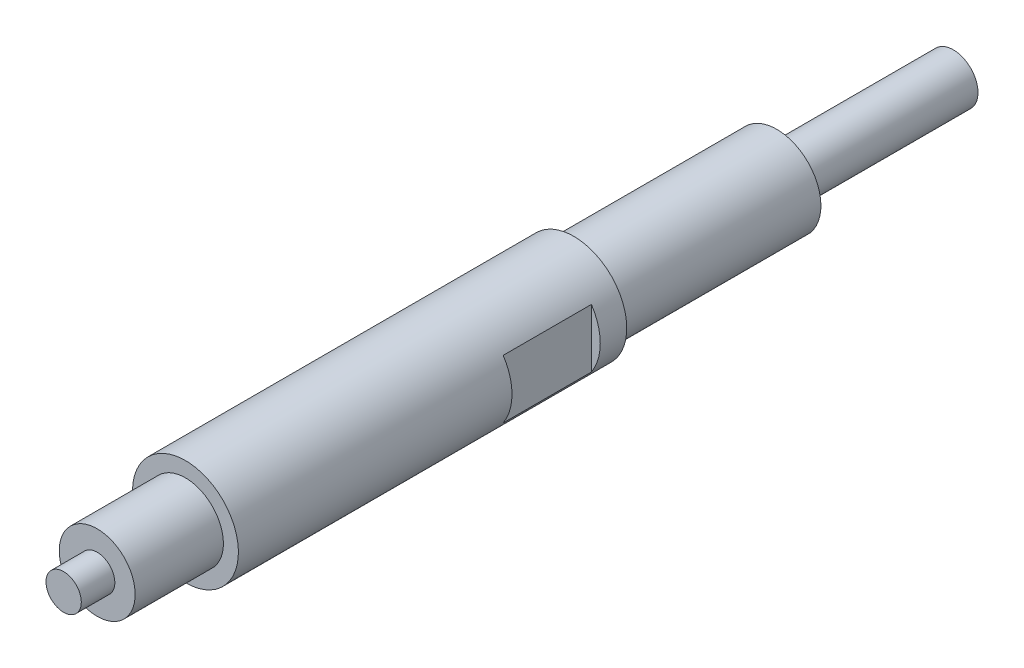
ISO-10303-21;
HEADER;
FILE_DESCRIPTION(('STEP AP214'),'2;1');
FILE_NAME('part.step','',(''),(''),'','','');
FILE_SCHEMA(('AUTOMOTIVE_DESIGN { 1 0 10303 214 1 1 1 1 }'));
ENDSEC;
DATA;
#1=APPLICATION_CONTEXT('core data for automotive mechanical design processes');
#2=APPLICATION_PROTOCOL_DEFINITION('international standard','automotive_design',2000,#1);
#3=PRODUCT_CONTEXT('',#1,'mechanical');
#4=PRODUCT('Part','Part','',(#3));
#5=PRODUCT_RELATED_PRODUCT_CATEGORY('part','',(#4));
#6=PRODUCT_DEFINITION_FORMATION('','',#4);
#7=PRODUCT_DEFINITION_CONTEXT('part definition',#1,'design');
#8=PRODUCT_DEFINITION('design','',#6,#7);
#9=PRODUCT_DEFINITION_SHAPE('','',#8);
#10=(LENGTH_UNIT() NAMED_UNIT(*) SI_UNIT(.MILLI.,.METRE.));
#11=(NAMED_UNIT(*) PLANE_ANGLE_UNIT() SI_UNIT($,.RADIAN.));
#12=(NAMED_UNIT(*) SI_UNIT($,.STERADIAN.) SOLID_ANGLE_UNIT());
#13=UNCERTAINTY_MEASURE_WITH_UNIT(LENGTH_MEASURE(1.E-05),#10,'distance_accuracy_value','');
#14=(GEOMETRIC_REPRESENTATION_CONTEXT(3) GLOBAL_UNCERTAINTY_ASSIGNED_CONTEXT((#13)) GLOBAL_UNIT_ASSIGNED_CONTEXT((#10,
#11,#12)) REPRESENTATION_CONTEXT('',''));
#15=CARTESIAN_POINT('',(0.,0.,0.));
#16=DIRECTION('',(0.,0.,1.));
#17=DIRECTION('',(1.,0.,0.));
#18=AXIS2_PLACEMENT_3D('',#15,#16,#17);
#19=CARTESIAN_POINT('',(1.,0.,-1.9));
#20=DIRECTION('',(0.,0.,-1.));
#21=DIRECTION('',(0.,1.,0.));
#22=AXIS2_PLACEMENT_3D('',#19,#20,#21);
#23=PLANE('',#22);
#24=CARTESIAN_POINT('',(0.,0.,-1.9));
#25=DIRECTION('',(0.,0.,1.));
#26=DIRECTION('',(0.,-1.,0.));
#27=AXIS2_PLACEMENT_3D('',#24,#25,#26);
#28=CIRCLE('',#27,1.);
#29=CARTESIAN_POINT('',(0.,-1.,-1.9));
#30=VERTEX_POINT('',#29);
#31=EDGE_CURVE('E108',#30,#30,#28,.T.);
#32=ORIENTED_EDGE('',*,*,#31,.F.);
#33=EDGE_LOOP('',(#32));
#34=FACE_BOUND('',#33,.T.);
#35=CARTESIAN_POINT('',(0.,0.,-1.9));
#36=DIRECTION('',(0.,0.,1.));
#37=DIRECTION('',(0.,-1.,0.));
#38=AXIS2_PLACEMENT_3D('',#35,#36,#37);
#39=CIRCLE('',#38,2.15);
#40=CARTESIAN_POINT('',(0.,-2.15,-1.9));
#41=VERTEX_POINT('',#40);
#42=EDGE_CURVE('E81',#41,#41,#39,.T.);
#43=ORIENTED_EDGE('',*,*,#42,.T.);
#44=EDGE_LOOP('',(#43));
#45=FACE_BOUND('',#44,.T.);
#46=ADVANCED_FACE('F14',(#34,#45),#23,.F.);
#47=CARTESIAN_POINT('',(0.,0.,6.09516340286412));
#48=DIRECTION('',(0.,0.,1.));
#49=DIRECTION('',(0.,-1.,0.));
#50=AXIS2_PLACEMENT_3D('',#47,#48,#49);
#51=CYLINDRICAL_SURFACE('',#50,2.15);
#52=ORIENTED_EDGE('',*,*,#42,.F.);
#53=EDGE_LOOP('',(#52));
#54=FACE_BOUND('',#53,.T.);
#55=CARTESIAN_POINT('',(0.,0.,-6.9));
#56=DIRECTION('',(0.,0.,1.));
#57=DIRECTION('',(0.,-1.,0.));
#58=AXIS2_PLACEMENT_3D('',#55,#56,#57);
#59=CIRCLE('',#58,2.15);
#60=CARTESIAN_POINT('',(0.,-2.15,-6.9));
#61=VERTEX_POINT('',#60);
#62=EDGE_CURVE('E84',#61,#61,#59,.T.);
#63=ORIENTED_EDGE('',*,*,#62,.T.);
#64=EDGE_LOOP('',(#63));
#65=FACE_BOUND('',#64,.T.);
#66=ADVANCED_FACE('F129',(#54,#65),#51,.T.);
#67=CARTESIAN_POINT('',(2.15,0.,-6.9));
#68=DIRECTION('',(0.,0.,-1.));
#69=DIRECTION('',(0.,1.,0.));
#70=AXIS2_PLACEMENT_3D('',#67,#68,#69);
#71=PLANE('',#70);
#72=ORIENTED_EDGE('',*,*,#62,.F.);
#73=EDGE_LOOP('',(#72));
#74=FACE_BOUND('',#73,.T.);
#75=CARTESIAN_POINT('',(0.,0.,-6.9));
#76=DIRECTION('',(0.,0.,1.));
#77=DIRECTION('',(0.,-1.,0.));
#78=AXIS2_PLACEMENT_3D('',#75,#76,#77);
#79=CIRCLE('',#78,3.);
#80=CARTESIAN_POINT('',(0.,-3.,-6.9));
#81=VERTEX_POINT('',#80);
#82=EDGE_CURVE('E87',#81,#81,#79,.T.);
#83=ORIENTED_EDGE('',*,*,#82,.T.);
#84=EDGE_LOOP('',(#83));
#85=FACE_BOUND('',#84,.T.);
#86=ADVANCED_FACE('F134',(#74,#85),#71,.F.);
#87=CARTESIAN_POINT('',(0.,0.,6.09516340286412));
#88=DIRECTION('',(0.,0.,1.));
#89=DIRECTION('',(0.,-1.,0.));
#90=AXIS2_PLACEMENT_3D('',#87,#88,#89);
#91=CYLINDRICAL_SURFACE('',#90,3.);
#92=DIRECTION('',(0.,0.,1.));
#93=VECTOR('',#92,1.);
#94=CARTESIAN_POINT('',(-2.5,1.65831239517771,6.09516340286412));
#95=LINE('',#94,#93);
#96=CARTESIAN_POINT('',(-2.5,1.65831239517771,-27.4));
#97=VERTEX_POINT('',#96);
#98=CARTESIAN_POINT('',(-2.5,1.65831239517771,-22.4));
#99=VERTEX_POINT('',#98);
#100=EDGE_CURVE('E21',#97,#99,#95,.T.);
#101=ORIENTED_EDGE('',*,*,#100,.T.);
#102=CARTESIAN_POINT('',(0.,0.,-22.4));
#103=DIRECTION('',(0.,0.,1.));
#104=DIRECTION('',(0.,-1.,0.));
#105=AXIS2_PLACEMENT_3D('',#102,#103,#104);
#106=CIRCLE('',#105,3.);
#107=CARTESIAN_POINT('',(-2.5,-1.6583123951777,-22.4));
#108=VERTEX_POINT('',#107);
#109=EDGE_CURVE('E9',#99,#108,#106,.T.);
#110=ORIENTED_EDGE('',*,*,#109,.T.);
#111=DIRECTION('',(0.,0.,1.));
#112=VECTOR('',#111,1.);
#113=CARTESIAN_POINT('',(-2.5,-1.6583123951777,6.09516340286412));
#114=LINE('',#113,#112);
#115=CARTESIAN_POINT('',(-2.5,-1.6583123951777,-27.4));
#116=VERTEX_POINT('',#115);
#117=EDGE_CURVE('E58',#108,#116,#114,.F.);
#118=ORIENTED_EDGE('',*,*,#117,.T.);
#119=CARTESIAN_POINT('',(0.,0.,-27.4));
#120=DIRECTION('',(0.,0.,-1.));
#121=DIRECTION('',(0.,1.,0.));
#122=AXIS2_PLACEMENT_3D('',#119,#120,#121);
#123=CIRCLE('',#122,3.);
#124=EDGE_CURVE('E53',#116,#97,#123,.T.);
#125=ORIENTED_EDGE('',*,*,#124,.T.);
#126=EDGE_LOOP('',(#101,#110,#118,#125));
#127=FACE_BOUND('',#126,.T.);
#128=CARTESIAN_POINT('',(0.,0.,-27.4));
#129=DIRECTION('',(0.,0.,-1.));
#130=DIRECTION('',(0.,1.,0.));
#131=AXIS2_PLACEMENT_3D('',#128,#129,#130);
#132=CIRCLE('',#131,3.);
#133=CARTESIAN_POINT('',(2.5,1.65831239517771,-27.4));
#134=VERTEX_POINT('',#133);
#135=CARTESIAN_POINT('',(2.5,-1.65831239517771,-27.4));
#136=VERTEX_POINT('',#135);
#137=EDGE_CURVE('E76',#134,#136,#132,.T.);
#138=ORIENTED_EDGE('',*,*,#137,.T.);
#139=DIRECTION('',(0.,0.,1.));
#140=VECTOR('',#139,1.);
#141=CARTESIAN_POINT('',(2.5,-1.65831239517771,6.09516340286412));
#142=LINE('',#141,#140);
#143=CARTESIAN_POINT('',(2.5,-1.65831239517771,-22.4));
#144=VERTEX_POINT('',#143);
#145=EDGE_CURVE('E59',#136,#144,#142,.T.);
#146=ORIENTED_EDGE('',*,*,#145,.T.);
#147=CARTESIAN_POINT('',(0.,0.,-22.4));
#148=DIRECTION('',(0.,0.,1.));
#149=DIRECTION('',(0.,-1.,0.));
#150=AXIS2_PLACEMENT_3D('',#147,#148,#149);
#151=CIRCLE('',#150,3.);
#152=CARTESIAN_POINT('',(2.5,1.65831239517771,-22.4));
#153=VERTEX_POINT('',#152);
#154=EDGE_CURVE('E73',#144,#153,#151,.T.);
#155=ORIENTED_EDGE('',*,*,#154,.T.);
#156=DIRECTION('',(0.,0.,1.));
#157=VECTOR('',#156,1.);
#158=CARTESIAN_POINT('',(2.5,1.65831239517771,6.09516340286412));
#159=LINE('',#158,#157);
#160=EDGE_CURVE('E78',#153,#134,#159,.F.);
#161=ORIENTED_EDGE('',*,*,#160,.T.);
#162=EDGE_LOOP('',(#138,#146,#155,#161));
#163=FACE_BOUND('',#162,.T.);
#164=ORIENTED_EDGE('',*,*,#82,.F.);
#165=EDGE_LOOP('',(#164));
#166=FACE_BOUND('',#165,.T.);
#167=CARTESIAN_POINT('',(0.,0.,-28.9));
#168=DIRECTION('',(0.,0.,1.));
#169=DIRECTION('',(0.,-1.,0.));
#170=AXIS2_PLACEMENT_3D('',#167,#168,#169);
#171=CIRCLE('',#170,3.);
#172=CARTESIAN_POINT('',(0.,-3.,-28.9));
#173=VERTEX_POINT('',#172);
#174=EDGE_CURVE('E90',#173,#173,#171,.T.);
#175=ORIENTED_EDGE('',*,*,#174,.T.);
#176=EDGE_LOOP('',(#175));
#177=FACE_BOUND('',#176,.T.);
#178=ADVANCED_FACE('F67',(#127,#163,#166,#177),#91,.T.);
#179=CARTESIAN_POINT('',(3.,0.,-28.9));
#180=DIRECTION('',(0.,0.,1.));
#181=DIRECTION('',(0.,-1.,0.));
#182=AXIS2_PLACEMENT_3D('',#179,#180,#181);
#183=PLANE('',#182);
#184=ORIENTED_EDGE('',*,*,#174,.F.);
#185=EDGE_LOOP('',(#184));
#186=FACE_BOUND('',#185,.T.);
#187=CARTESIAN_POINT('',(0.,0.,-28.9));
#188=DIRECTION('',(0.,0.,1.));
#189=DIRECTION('',(0.,-1.,0.));
#190=AXIS2_PLACEMENT_3D('',#187,#188,#189);
#191=CIRCLE('',#190,2.5);
#192=CARTESIAN_POINT('',(0.,-2.5,-28.9));
#193=VERTEX_POINT('',#192);
#194=EDGE_CURVE('E93',#193,#193,#191,.T.);
#195=ORIENTED_EDGE('',*,*,#194,.T.);
#196=EDGE_LOOP('',(#195));
#197=FACE_BOUND('',#196,.T.);
#198=ADVANCED_FACE('F149',(#186,#197),#183,.F.);
#199=CARTESIAN_POINT('',(0.,0.,6.09516340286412));
#200=DIRECTION('',(0.,0.,1.));
#201=DIRECTION('',(0.,-1.,0.));
#202=AXIS2_PLACEMENT_3D('',#199,#200,#201);
#203=CYLINDRICAL_SURFACE('',#202,2.5);
#204=ORIENTED_EDGE('',*,*,#194,.F.);
#205=EDGE_LOOP('',(#204));
#206=FACE_BOUND('',#205,.T.);
#207=CARTESIAN_POINT('',(0.,0.,-40.4));
#208=DIRECTION('',(0.,0.,1.));
#209=DIRECTION('',(0.,-1.,0.));
#210=AXIS2_PLACEMENT_3D('',#207,#208,#209);
#211=CIRCLE('',#210,2.5);
#212=CARTESIAN_POINT('',(0.,-2.5,-40.4));
#213=VERTEX_POINT('',#212);
#214=EDGE_CURVE('E96',#213,#213,#211,.T.);
#215=ORIENTED_EDGE('',*,*,#214,.T.);
#216=EDGE_LOOP('',(#215));
#217=FACE_BOUND('',#216,.T.);
#218=ADVANCED_FACE('F155',(#206,#217),#203,.T.);
#219=CARTESIAN_POINT('',(2.5,0.,-40.4));
#220=DIRECTION('',(0.,0.,1.));
#221=DIRECTION('',(0.,-1.,0.));
#222=AXIS2_PLACEMENT_3D('',#219,#220,#221);
#223=PLANE('',#222);
#224=ORIENTED_EDGE('',*,*,#214,.F.);
#225=EDGE_LOOP('',(#224));
#226=FACE_BOUND('',#225,.T.);
#227=CARTESIAN_POINT('',(0.,0.,-40.4));
#228=DIRECTION('',(0.,0.,1.));
#229=DIRECTION('',(0.,-1.,0.));
#230=AXIS2_PLACEMENT_3D('',#227,#228,#229);
#231=CIRCLE('',#230,1.4);
#232=CARTESIAN_POINT('',(0.,-1.4,-40.4));
#233=VERTEX_POINT('',#232);
#234=EDGE_CURVE('E99',#233,#233,#231,.T.);
#235=ORIENTED_EDGE('',*,*,#234,.T.);
#236=EDGE_LOOP('',(#235));
#237=FACE_BOUND('',#236,.T.);
#238=ADVANCED_FACE('F161',(#226,#237),#223,.F.);
#239=CARTESIAN_POINT('',(0.,0.,6.09516340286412));
#240=DIRECTION('',(0.,0.,1.));
#241=DIRECTION('',(0.,-1.,0.));
#242=AXIS2_PLACEMENT_3D('',#239,#240,#241);
#243=CYLINDRICAL_SURFACE('',#242,1.4);
#244=ORIENTED_EDGE('',*,*,#234,.F.);
#245=EDGE_LOOP('',(#244));
#246=FACE_BOUND('',#245,.T.);
#247=CARTESIAN_POINT('',(0.,0.,-50.4));
#248=DIRECTION('',(0.,0.,1.));
#249=DIRECTION('',(0.,-1.,0.));
#250=AXIS2_PLACEMENT_3D('',#247,#248,#249);
#251=CIRCLE('',#250,1.4);
#252=CARTESIAN_POINT('',(0.,-1.4,-50.4));
#253=VERTEX_POINT('',#252);
#254=EDGE_CURVE('E102',#253,#253,#251,.T.);
#255=ORIENTED_EDGE('',*,*,#254,.T.);
#256=EDGE_LOOP('',(#255));
#257=FACE_BOUND('',#256,.T.);
#258=ADVANCED_FACE('F167',(#246,#257),#243,.T.);
#259=CARTESIAN_POINT('',(1.4,0.,-50.4));
#260=DIRECTION('',(0.,0.,1.));
#261=DIRECTION('',(0.,-1.,0.));
#262=AXIS2_PLACEMENT_3D('',#259,#260,#261);
#263=PLANE('',#262);
#264=ORIENTED_EDGE('',*,*,#254,.F.);
#265=EDGE_LOOP('',(#264));
#266=FACE_BOUND('',#265,.T.);
#267=ADVANCED_FACE('F173',(#266),#263,.F.);
#268=CARTESIAN_POINT('',(1.,0.,0.));
#269=DIRECTION('',(0.,0.,-1.));
#270=DIRECTION('',(0.,1.,0.));
#271=AXIS2_PLACEMENT_3D('',#268,#269,#270);
#272=PLANE('',#271);
#273=CARTESIAN_POINT('',(0.,0.,0.));
#274=DIRECTION('',(0.,0.,1.));
#275=DIRECTION('',(0.,-1.,0.));
#276=AXIS2_PLACEMENT_3D('',#273,#274,#275);
#277=CIRCLE('',#276,1.);
#278=CARTESIAN_POINT('',(0.,-1.,0.));
#279=VERTEX_POINT('',#278);
#280=EDGE_CURVE('E105',#279,#279,#277,.T.);
#281=ORIENTED_EDGE('',*,*,#280,.T.);
#282=EDGE_LOOP('',(#281));
#283=FACE_BOUND('',#282,.T.);
#284=ADVANCED_FACE('F178',(#283),#272,.F.);
#285=CARTESIAN_POINT('',(0.,0.,6.09516340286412));
#286=DIRECTION('',(0.,0.,1.));
#287=DIRECTION('',(0.,-1.,0.));
#288=AXIS2_PLACEMENT_3D('',#285,#286,#287);
#289=CYLINDRICAL_SURFACE('',#288,1.);
#290=ORIENTED_EDGE('',*,*,#280,.F.);
#291=EDGE_LOOP('',(#290));
#292=FACE_BOUND('',#291,.T.);
#293=ORIENTED_EDGE('',*,*,#31,.T.);
#294=EDGE_LOOP('',(#293));
#295=FACE_BOUND('',#294,.T.);
#296=ADVANCED_FACE('F183',(#292,#295),#289,.T.);
#297=CARTESIAN_POINT('',(3.,3.,-22.4));
#298=DIRECTION('',(0.,0.,1.));
#299=DIRECTION('',(0.,-1.,0.));
#300=AXIS2_PLACEMENT_3D('',#297,#298,#299);
#301=PLANE('',#300);
#302=DIRECTION('',(0.,-1.,0.));
#303=VECTOR('',#302,1.);
#304=CARTESIAN_POINT('',(2.5,3.,-22.4));
#305=LINE('',#304,#303);
#306=EDGE_CURVE('E111',#153,#144,#305,.T.);
#307=ORIENTED_EDGE('',*,*,#306,.F.);
#308=ORIENTED_EDGE('',*,*,#154,.F.);
#309=EDGE_LOOP('',(#307,#308));
#310=FACE_BOUND('',#309,.T.);
#311=ADVANCED_FACE('F189',(#310),#301,.F.);
#312=CARTESIAN_POINT('',(3.,3.,-27.4));
#313=DIRECTION('',(0.,0.,-1.));
#314=DIRECTION('',(0.,1.,0.));
#315=AXIS2_PLACEMENT_3D('',#312,#313,#314);
#316=PLANE('',#315);
#317=DIRECTION('',(0.,-1.,0.));
#318=VECTOR('',#317,1.);
#319=CARTESIAN_POINT('',(2.5,3.,-27.4));
#320=LINE('',#319,#318);
#321=EDGE_CURVE('E35',#134,#136,#320,.T.);
#322=ORIENTED_EDGE('',*,*,#321,.T.);
#323=ORIENTED_EDGE('',*,*,#137,.F.);
#324=EDGE_LOOP('',(#322,#323));
#325=FACE_BOUND('',#324,.T.);
#326=ADVANCED_FACE('F126',(#325),#316,.F.);
#327=CARTESIAN_POINT('',(2.5,3.,-22.4));
#328=DIRECTION('',(-1.,0.,0.));
#329=DIRECTION('',(0.,1.,0.));
#330=AXIS2_PLACEMENT_3D('',#327,#328,#329);
#331=PLANE('',#330);
#332=ORIENTED_EDGE('',*,*,#321,.F.);
#333=ORIENTED_EDGE('',*,*,#160,.F.);
#334=ORIENTED_EDGE('',*,*,#306,.T.);
#335=ORIENTED_EDGE('',*,*,#145,.F.);
#336=EDGE_LOOP('',(#332,#333,#334,#335));
#337=FACE_BOUND('',#336,.T.);
#338=ADVANCED_FACE('F118',(#337),#331,.F.);
#339=CARTESIAN_POINT('',(-3.,3.,-22.4));
#340=DIRECTION('',(0.,0.,1.));
#341=DIRECTION('',(0.,-1.,0.));
#342=AXIS2_PLACEMENT_3D('',#339,#340,#341);
#343=PLANE('',#342);
#344=DIRECTION('',(0.,-1.,0.));
#345=VECTOR('',#344,1.);
#346=CARTESIAN_POINT('',(-2.5,3.,-22.4));
#347=LINE('',#346,#345);
#348=EDGE_CURVE('E65',#99,#108,#347,.T.);
#349=ORIENTED_EDGE('',*,*,#348,.T.);
#350=ORIENTED_EDGE('',*,*,#109,.F.);
#351=EDGE_LOOP('',(#349,#350));
#352=FACE_BOUND('',#351,.T.);
#353=ADVANCED_FACE('F116',(#352),#343,.F.);
#354=CARTESIAN_POINT('',(-2.5,3.,-22.4));
#355=DIRECTION('',(1.,0.,0.));
#356=DIRECTION('',(0.,-1.,0.));
#357=AXIS2_PLACEMENT_3D('',#354,#355,#356);
#358=PLANE('',#357);
#359=DIRECTION('',(0.,-1.,0.));
#360=VECTOR('',#359,1.);
#361=CARTESIAN_POINT('',(-2.5,3.,-27.4));
#362=LINE('',#361,#360);
#363=EDGE_CURVE('E27',#97,#116,#362,.T.);
#364=ORIENTED_EDGE('',*,*,#363,.T.);
#365=ORIENTED_EDGE('',*,*,#117,.F.);
#366=ORIENTED_EDGE('',*,*,#348,.F.);
#367=ORIENTED_EDGE('',*,*,#100,.F.);
#368=EDGE_LOOP('',(#364,#365,#366,#367));
#369=FACE_BOUND('',#368,.T.);
#370=ADVANCED_FACE('F62',(#369),#358,.F.);
#371=CARTESIAN_POINT('',(-3.,3.,-27.4));
#372=DIRECTION('',(0.,0.,-1.));
#373=DIRECTION('',(0.,1.,0.));
#374=AXIS2_PLACEMENT_3D('',#371,#372,#373);
#375=PLANE('',#374);
#376=ORIENTED_EDGE('',*,*,#363,.F.);
#377=ORIENTED_EDGE('',*,*,#124,.F.);
#378=EDGE_LOOP('',(#376,#377));
#379=FACE_BOUND('',#378,.T.);
#380=ADVANCED_FACE('F54',(#379),#375,.F.);
#381=CLOSED_SHELL('',(#46,#66,#86,#178,#198,#218,#238,#258,#267,#284,#296,#311,#326,#338,#353,
#370,#380));
#382=MANIFOLD_SOLID_BREP('B1',#381);
#383=ADVANCED_BREP_SHAPE_REPRESENTATION('',(#18,#382),#14);
#384=SHAPE_DEFINITION_REPRESENTATION(#9,#383);
ENDSEC;
END-ISO-10303-21;
